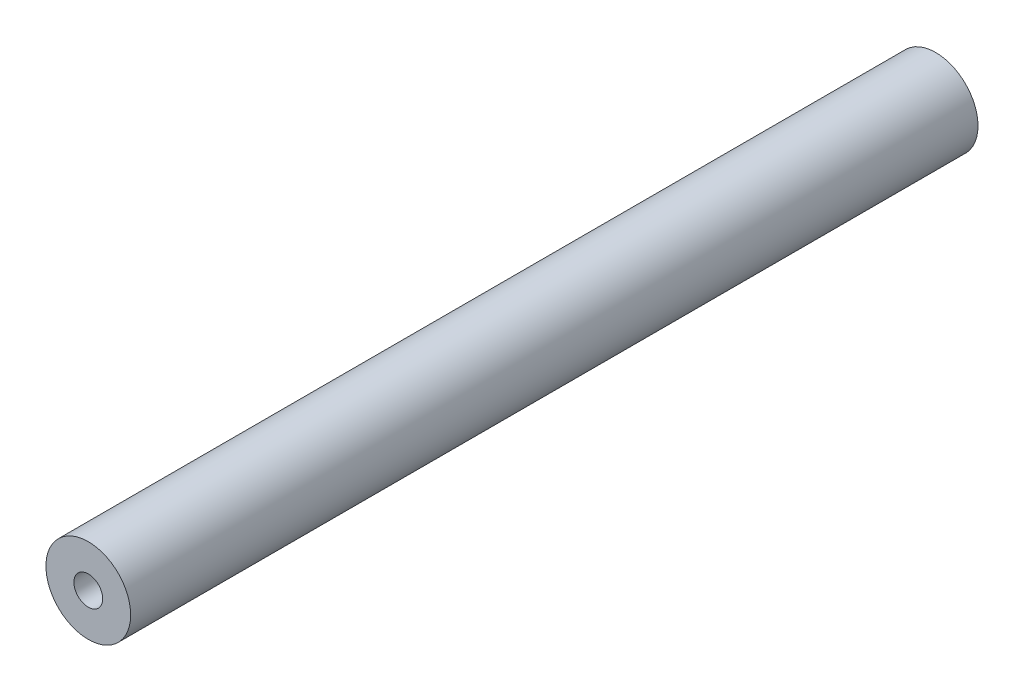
from build123d import *

# Parameters (mm, degrees)
SKETCH_1_R             = 10
EXTRUDE_1_DEPTH        = 200
HOLE_WIZARD_M8_1_D     = 6.8
HOLE_WIZARD_M8_1_DEPTH = 19.75
HOLE_WIZARD_M8_1_TIP   = 2.042926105
HOLE_WIZARD_M8_2_D     = 6.8
HOLE_WIZARD_M8_2_DEPTH = 19.75
HOLE_WIZARD_M8_2_TIP   = 2.042926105


with BuildPart() as part:
    # Sketch 1 → Extrude 1 (new body)
    with BuildSketch(Plane.XY):
        Circle(SKETCH_1_R)
    extrude(amount=EXTRUDE_1_DEPTH)

    # Hole Wizard M8 _1
    with Locations(Plane(origin=(0, 0, 0), x_dir=(-1, 0, 0), z_dir=(0, 0, -1))):
        with Locations((0, 0)):
            Hole(HOLE_WIZARD_M8_1_D / 2, depth=HOLE_WIZARD_M8_1_DEPTH)
            with Locations((0, 0, -(HOLE_WIZARD_M8_1_DEPTH + HOLE_WIZARD_M8_1_TIP / 2))):  # 118° drill point
                Cone(0, HOLE_WIZARD_M8_1_D / 2, HOLE_WIZARD_M8_1_TIP, mode=Mode.SUBTRACT)

    # Hole Wizard M8 _2
    with Locations(Plane.XY.offset(200)):
        with Locations((0, 0)):
            Hole(HOLE_WIZARD_M8_2_D / 2, depth=HOLE_WIZARD_M8_2_DEPTH)
            with Locations((0, 0, -(HOLE_WIZARD_M8_2_DEPTH + HOLE_WIZARD_M8_2_TIP / 2))):  # 118° drill point
                Cone(0, HOLE_WIZARD_M8_2_D / 2, HOLE_WIZARD_M8_2_TIP, mode=Mode.SUBTRACT)


solid = part.part
